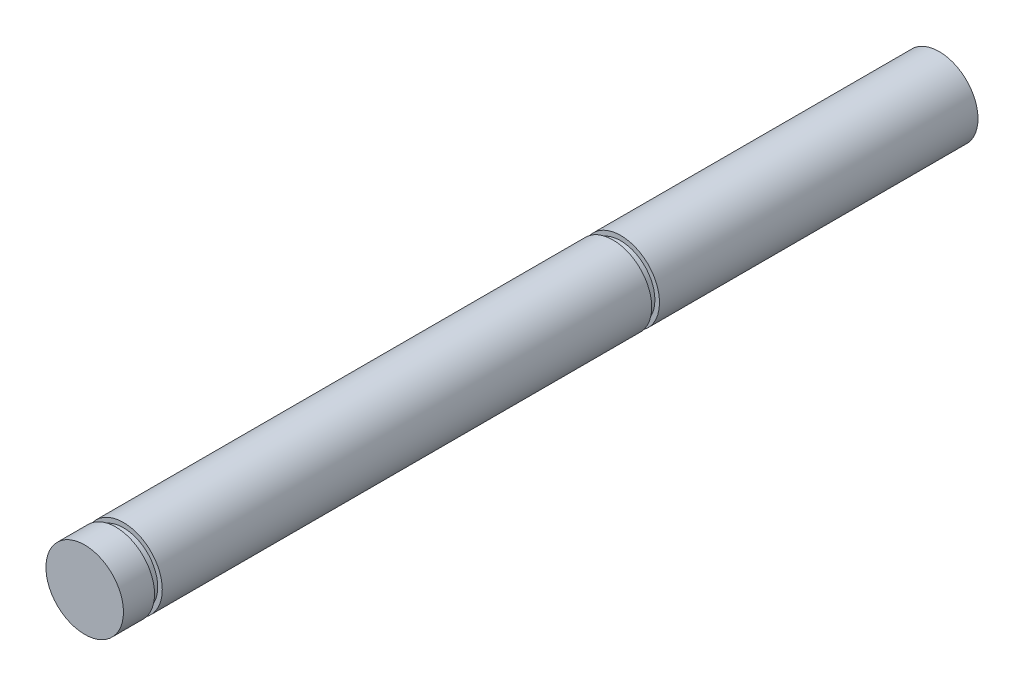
ISO-10303-21;
HEADER;
FILE_DESCRIPTION(('STEP AP214'),'2;1');
FILE_NAME('part.step','',(''),(''),'','','');
FILE_SCHEMA(('AUTOMOTIVE_DESIGN { 1 0 10303 214 1 1 1 1 }'));
ENDSEC;
DATA;
#1=APPLICATION_CONTEXT('core data for automotive mechanical design processes');
#2=APPLICATION_PROTOCOL_DEFINITION('international standard','automotive_design',2000,#1);
#3=PRODUCT_CONTEXT('',#1,'mechanical');
#4=PRODUCT('Part','Part','',(#3));
#5=PRODUCT_RELATED_PRODUCT_CATEGORY('part','',(#4));
#6=PRODUCT_DEFINITION_FORMATION('','',#4);
#7=PRODUCT_DEFINITION_CONTEXT('part definition',#1,'design');
#8=PRODUCT_DEFINITION('design','',#6,#7);
#9=PRODUCT_DEFINITION_SHAPE('','',#8);
#10=(LENGTH_UNIT() NAMED_UNIT(*) SI_UNIT(.MILLI.,.METRE.));
#11=(NAMED_UNIT(*) PLANE_ANGLE_UNIT() SI_UNIT($,.RADIAN.));
#12=(NAMED_UNIT(*) SI_UNIT($,.STERADIAN.) SOLID_ANGLE_UNIT());
#13=UNCERTAINTY_MEASURE_WITH_UNIT(LENGTH_MEASURE(1.E-05),#10,'distance_accuracy_value','');
#14=(GEOMETRIC_REPRESENTATION_CONTEXT(3) GLOBAL_UNCERTAINTY_ASSIGNED_CONTEXT((#13)) GLOBAL_UNIT_ASSIGNED_CONTEXT((#10,
#11,#12)) REPRESENTATION_CONTEXT('',''));
#15=CARTESIAN_POINT('',(0.,0.,0.));
#16=DIRECTION('',(0.,0.,1.));
#17=DIRECTION('',(1.,0.,0.));
#18=AXIS2_PLACEMENT_3D('',#15,#16,#17);
#19=CARTESIAN_POINT('',(0.,0.,34.925));
#20=DIRECTION('',(0.,0.,-1.));
#21=DIRECTION('',(-1.,0.,0.));
#22=AXIS2_PLACEMENT_3D('',#19,#20,#21);
#23=CYLINDRICAL_SURFACE('',#22,3.16865);
#24=CARTESIAN_POINT('',(0.,0.,31.7517650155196));
#25=DIRECTION('',(0.,0.,1.));
#26=DIRECTION('',(1.,0.,0.));
#27=AXIS2_PLACEMENT_3D('',#24,#25,#26);
#28=CIRCLE('',#27,3.16865);
#29=CARTESIAN_POINT('',(3.16865,0.,31.7517650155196));
#30=VERTEX_POINT('',#29);
#31=EDGE_CURVE('E43',#30,#30,#28,.F.);
#32=ORIENTED_EDGE('',*,*,#31,.T.);
#33=EDGE_LOOP('',(#32));
#34=FACE_BOUND('',#33,.T.);
#35=CARTESIAN_POINT('',(0.,0.,-8.25500000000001));
#36=DIRECTION('',(0.,0.,1.));
#37=DIRECTION('',(1.,0.,0.));
#38=AXIS2_PLACEMENT_3D('',#35,#36,#37);
#39=CIRCLE('',#38,3.16865);
#40=CARTESIAN_POINT('',(3.16865,0.,-8.25500000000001));
#41=VERTEX_POINT('',#40);
#42=EDGE_CURVE('E52',#41,#41,#39,.T.);
#43=ORIENTED_EDGE('',*,*,#42,.T.);
#44=EDGE_LOOP('',(#43));
#45=FACE_BOUND('',#44,.T.);
#46=ADVANCED_FACE('F39',(#34,#45),#23,.T.);
#47=CARTESIAN_POINT('',(29.7515816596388,0.,-8.255));
#48=DIRECTION('',(0.,0.,1.));
#49=DIRECTION('',(1.,0.,0.));
#50=AXIS2_PLACEMENT_3D('',#47,#48,#49);
#51=PLANE('',#50);
#52=CARTESIAN_POINT('',(0.,0.,-8.255));
#53=DIRECTION('',(0.,0.,1.));
#54=DIRECTION('',(1.,0.,0.));
#55=AXIS2_PLACEMENT_3D('',#52,#53,#54);
#56=CIRCLE('',#55,2.794);
#57=CARTESIAN_POINT('',(2.794,0.,-8.255));
#58=VERTEX_POINT('',#57);
#59=EDGE_CURVE('E59',#58,#58,#56,.T.);
#60=ORIENTED_EDGE('',*,*,#59,.T.);
#61=EDGE_LOOP('',(#60));
#62=FACE_BOUND('',#61,.T.);
#63=ORIENTED_EDGE('',*,*,#42,.F.);
#64=EDGE_LOOP('',(#63));
#65=FACE_BOUND('',#64,.T.);
#66=ADVANCED_FACE('F80',(#62,#65),#51,.F.);
#67=CARTESIAN_POINT('',(29.7515816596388,0.,-8.89));
#68=DIRECTION('',(0.,0.,-1.));
#69=DIRECTION('',(-1.,0.,0.));
#70=AXIS2_PLACEMENT_3D('',#67,#68,#69);
#71=PLANE('',#70);
#72=CARTESIAN_POINT('',(0.,0.,-8.89));
#73=DIRECTION('',(0.,0.,1.));
#74=DIRECTION('',(1.,0.,0.));
#75=AXIS2_PLACEMENT_3D('',#72,#73,#74);
#76=CIRCLE('',#75,2.794);
#77=CARTESIAN_POINT('',(2.794,0.,-8.89));
#78=VERTEX_POINT('',#77);
#79=EDGE_CURVE('E67',#78,#78,#76,.T.);
#80=ORIENTED_EDGE('',*,*,#79,.F.);
#81=EDGE_LOOP('',(#80));
#82=FACE_BOUND('',#81,.T.);
#83=CARTESIAN_POINT('',(0.,0.,-8.89));
#84=DIRECTION('',(0.,0.,-1.));
#85=DIRECTION('',(-1.,0.,0.));
#86=AXIS2_PLACEMENT_3D('',#83,#84,#85);
#87=CIRCLE('',#86,3.16865);
#88=CARTESIAN_POINT('',(-3.16865,0.,-8.89));
#89=VERTEX_POINT('',#88);
#90=EDGE_CURVE('E56',#89,#89,#87,.T.);
#91=ORIENTED_EDGE('',*,*,#90,.F.);
#92=EDGE_LOOP('',(#91));
#93=FACE_BOUND('',#92,.T.);
#94=ADVANCED_FACE('F87',(#82,#93),#71,.F.);
#95=CARTESIAN_POINT('',(0.,0.,0.));
#96=DIRECTION('',(0.,0.,1.));
#97=DIRECTION('',(1.,0.,0.));
#98=AXIS2_PLACEMENT_3D('',#95,#96,#97);
#99=CYLINDRICAL_SURFACE('',#98,2.794);
#100=ORIENTED_EDGE('',*,*,#59,.F.);
#101=EDGE_LOOP('',(#100));
#102=FACE_BOUND('',#101,.T.);
#103=ORIENTED_EDGE('',*,*,#79,.T.);
#104=EDGE_LOOP('',(#103));
#105=FACE_BOUND('',#104,.T.);
#106=ADVANCED_FACE('F83',(#102,#105),#99,.T.);
#107=CARTESIAN_POINT('',(0.,0.,-34.925));
#108=DIRECTION('',(0.,0.,1.));
#109=DIRECTION('',(1.,0.,0.));
#110=AXIS2_PLACEMENT_3D('',#107,#108,#109);
#111=PLANE('',#110);
#112=CARTESIAN_POINT('',(0.,0.,-34.925));
#113=DIRECTION('',(0.,0.,1.));
#114=DIRECTION('',(1.,0.,0.));
#115=AXIS2_PLACEMENT_3D('',#112,#113,#114);
#116=CIRCLE('',#115,3.16865);
#117=CARTESIAN_POINT('',(3.16865,0.,-34.925));
#118=VERTEX_POINT('',#117);
#119=EDGE_CURVE('E47',#118,#118,#116,.T.);
#120=ORIENTED_EDGE('',*,*,#119,.F.);
#121=EDGE_LOOP('',(#120));
#122=FACE_BOUND('',#121,.T.);
#123=ADVANCED_FACE('F86',(#122),#111,.F.);
#124=ORIENTED_EDGE('',*,*,#90,.T.);
#125=EDGE_LOOP('',(#124));
#126=FACE_BOUND('',#125,.T.);
#127=ORIENTED_EDGE('',*,*,#119,.T.);
#128=EDGE_LOOP('',(#127));
#129=FACE_BOUND('',#128,.T.);
#130=ADVANCED_FACE('F41',(#126,#129),#23,.T.);
#131=CARTESIAN_POINT('',(0.,0.,31.877));
#132=DIRECTION('',(0.,0.,1.));
#133=DIRECTION('',(1.,0.,0.));
#134=AXIS2_PLACEMENT_3D('',#131,#132,#133);
#135=CONICAL_SURFACE('',#134,29.7515816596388,1.56608525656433);
#136=CARTESIAN_POINT('',(0.,0.,31.75));
#137=DIRECTION('',(0.,0.,1.));
#138=DIRECTION('',(1.,0.,0.));
#139=AXIS2_PLACEMENT_3D('',#136,#137,#138);
#140=CIRCLE('',#139,2.794);
#141=CARTESIAN_POINT('',(2.794,0.,31.75));
#142=VERTEX_POINT('',#141);
#143=EDGE_CURVE('E63',#142,#142,#140,.T.);
#144=ORIENTED_EDGE('',*,*,#143,.F.);
#145=EDGE_LOOP('',(#144));
#146=FACE_BOUND('',#145,.T.);
#147=ORIENTED_EDGE('',*,*,#31,.F.);
#148=EDGE_LOOP('',(#147));
#149=FACE_BOUND('',#148,.T.);
#150=ADVANCED_FACE('F98',(#146,#149),#135,.F.);
#151=CARTESIAN_POINT('',(29.7515816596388,0.,32.385));
#152=DIRECTION('',(0.,0.,1.));
#153=DIRECTION('',(1.,0.,0.));
#154=AXIS2_PLACEMENT_3D('',#151,#152,#153);
#155=PLANE('',#154);
#156=CARTESIAN_POINT('',(0.,0.,32.385));
#157=DIRECTION('',(0.,0.,1.));
#158=DIRECTION('',(1.,0.,0.));
#159=AXIS2_PLACEMENT_3D('',#156,#157,#158);
#160=CIRCLE('',#159,2.794);
#161=CARTESIAN_POINT('',(2.794,0.,32.385));
#162=VERTEX_POINT('',#161);
#163=EDGE_CURVE('E69',#162,#162,#160,.T.);
#164=ORIENTED_EDGE('',*,*,#163,.T.);
#165=EDGE_LOOP('',(#164));
#166=FACE_BOUND('',#165,.T.);
#167=CARTESIAN_POINT('',(0.,0.,32.385));
#168=DIRECTION('',(0.,0.,1.));
#169=DIRECTION('',(1.,0.,0.));
#170=AXIS2_PLACEMENT_3D('',#167,#168,#169);
#171=CIRCLE('',#170,3.16865);
#172=CARTESIAN_POINT('',(3.16865,0.,32.385));
#173=VERTEX_POINT('',#172);
#174=EDGE_CURVE('E61',#173,#173,#171,.T.);
#175=ORIENTED_EDGE('',*,*,#174,.F.);
#176=EDGE_LOOP('',(#175));
#177=FACE_BOUND('',#176,.T.);
#178=ADVANCED_FACE('F123',(#166,#177),#155,.F.);
#179=CARTESIAN_POINT('',(0.,0.,0.));
#180=DIRECTION('',(0.,0.,1.));
#181=DIRECTION('',(1.,0.,0.));
#182=AXIS2_PLACEMENT_3D('',#179,#180,#181);
#183=CYLINDRICAL_SURFACE('',#182,2.794);
#184=ORIENTED_EDGE('',*,*,#163,.F.);
#185=EDGE_LOOP('',(#184));
#186=FACE_BOUND('',#185,.T.);
#187=ORIENTED_EDGE('',*,*,#143,.T.);
#188=EDGE_LOOP('',(#187));
#189=FACE_BOUND('',#188,.T.);
#190=ADVANCED_FACE('F119',(#186,#189),#183,.T.);
#191=CARTESIAN_POINT('',(0.,0.,34.925));
#192=DIRECTION('',(0.,0.,1.));
#193=DIRECTION('',(1.,0.,0.));
#194=AXIS2_PLACEMENT_3D('',#191,#192,#193);
#195=PLANE('',#194);
#196=CARTESIAN_POINT('',(0.,0.,34.925));
#197=DIRECTION('',(0.,0.,1.));
#198=DIRECTION('',(1.,0.,0.));
#199=AXIS2_PLACEMENT_3D('',#196,#197,#198);
#200=CIRCLE('',#199,3.16865);
#201=CARTESIAN_POINT('',(3.16865,0.,34.925));
#202=VERTEX_POINT('',#201);
#203=EDGE_CURVE('E12',#202,#202,#200,.T.);
#204=ORIENTED_EDGE('',*,*,#203,.T.);
#205=EDGE_LOOP('',(#204));
#206=FACE_BOUND('',#205,.T.);
#207=ADVANCED_FACE('F115',(#206),#195,.T.);
#208=ORIENTED_EDGE('',*,*,#174,.T.);
#209=EDGE_LOOP('',(#208));
#210=FACE_BOUND('',#209,.T.);
#211=ORIENTED_EDGE('',*,*,#203,.F.);
#212=EDGE_LOOP('',(#211));
#213=FACE_BOUND('',#212,.T.);
#214=ADVANCED_FACE('F99',(#210,#213),#23,.T.);
#215=CLOSED_SHELL('',(#46,#66,#94,#106,#123,#130,#150,#178,#190,#207,#214));
#216=MANIFOLD_SOLID_BREP('B2',#215);
#217=ADVANCED_BREP_SHAPE_REPRESENTATION('',(#18,#216),#14);
#218=SHAPE_DEFINITION_REPRESENTATION(#9,#217);
ENDSEC;
END-ISO-10303-21;
